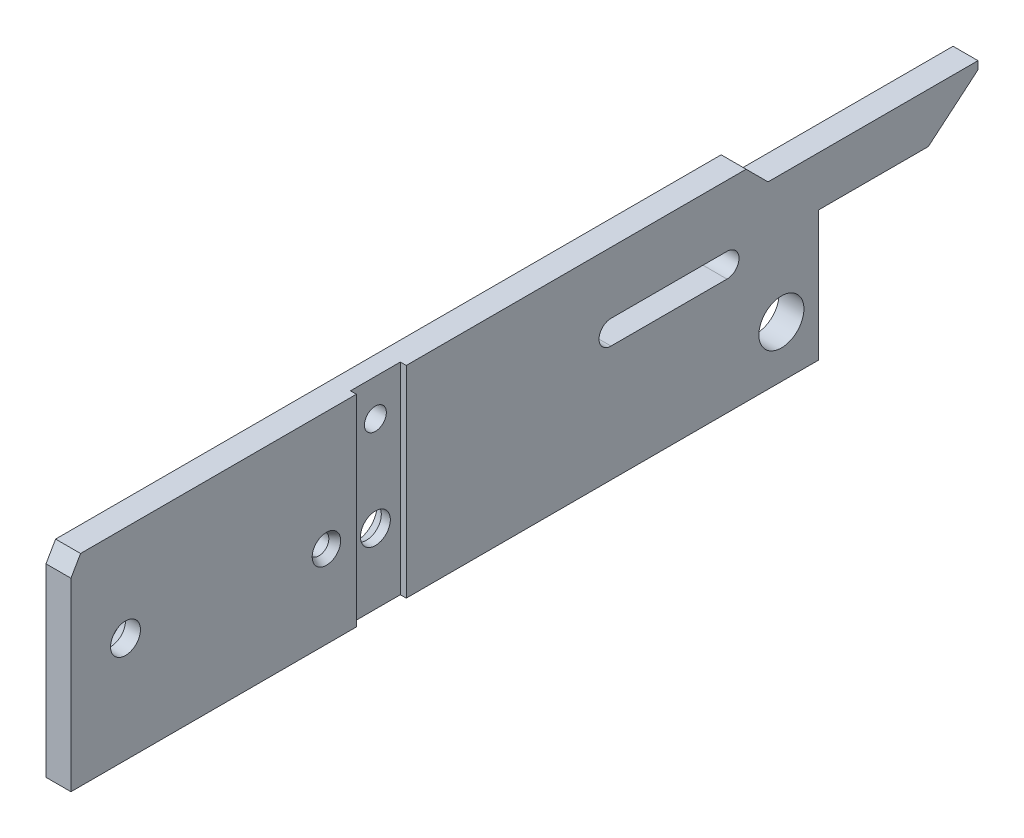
ISO-10303-21;
HEADER;
FILE_DESCRIPTION(('STEP AP214'),'2;1');
FILE_NAME('part.step','',(''),(''),'','','');
FILE_SCHEMA(('AUTOMOTIVE_DESIGN { 1 0 10303 214 1 1 1 1 }'));
ENDSEC;
DATA;
#1=APPLICATION_CONTEXT('core data for automotive mechanical design processes');
#2=APPLICATION_PROTOCOL_DEFINITION('international standard','automotive_design',2000,#1);
#3=PRODUCT_CONTEXT('',#1,'mechanical');
#4=PRODUCT('Part','Part','',(#3));
#5=PRODUCT_RELATED_PRODUCT_CATEGORY('part','',(#4));
#6=PRODUCT_DEFINITION_FORMATION('','',#4);
#7=PRODUCT_DEFINITION_CONTEXT('part definition',#1,'design');
#8=PRODUCT_DEFINITION('design','',#6,#7);
#9=PRODUCT_DEFINITION_SHAPE('','',#8);
#10=(LENGTH_UNIT() NAMED_UNIT(*) SI_UNIT(.MILLI.,.METRE.));
#11=(NAMED_UNIT(*) PLANE_ANGLE_UNIT() SI_UNIT($,.RADIAN.));
#12=(NAMED_UNIT(*) SI_UNIT($,.STERADIAN.) SOLID_ANGLE_UNIT());
#13=UNCERTAINTY_MEASURE_WITH_UNIT(LENGTH_MEASURE(1.E-05),#10,'distance_accuracy_value','');
#14=(GEOMETRIC_REPRESENTATION_CONTEXT(3) GLOBAL_UNCERTAINTY_ASSIGNED_CONTEXT((#13)) GLOBAL_UNIT_ASSIGNED_CONTEXT((#10,
#11,#12)) REPRESENTATION_CONTEXT('',''));
#15=CARTESIAN_POINT('',(0.,0.,0.));
#16=DIRECTION('',(0.,0.,1.));
#17=DIRECTION('',(1.,0.,0.));
#18=AXIS2_PLACEMENT_3D('',#15,#16,#17);
#19=CARTESIAN_POINT('',(3.9624,0.,0.));
#20=DIRECTION('',(-1.,0.,0.));
#21=DIRECTION('',(0.,0.,1.));
#22=AXIS2_PLACEMENT_3D('',#19,#20,#21);
#23=PLANE('',#22);
#24=CARTESIAN_POINT('',(3.9624,4.9276,72.2376));
#25=DIRECTION('',(-1.,0.,0.));
#26=DIRECTION('',(0.,0.,1.));
#27=AXIS2_PLACEMENT_3D('',#24,#25,#26);
#28=CIRCLE('',#27,2.26220766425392);
#29=CARTESIAN_POINT('',(3.9624,4.9276,74.4998076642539));
#30=VERTEX_POINT('',#29);
#31=EDGE_CURVE('E12',#30,#30,#28,.T.);
#32=ORIENTED_EDGE('',*,*,#31,.T.);
#33=EDGE_LOOP('',(#32));
#34=FACE_BOUND('',#33,.T.);
#35=CARTESIAN_POINT('',(3.9624,8.5852,104.14));
#36=DIRECTION('',(1.,0.,0.));
#37=DIRECTION('',(0.,0.,-1.));
#38=AXIS2_PLACEMENT_3D('',#35,#36,#37);
#39=CIRCLE('',#38,2.3749);
#40=CARTESIAN_POINT('',(3.9624,8.5852,101.7651));
#41=VERTEX_POINT('',#40);
#42=EDGE_CURVE('E224',#41,#41,#39,.T.);
#43=ORIENTED_EDGE('',*,*,#42,.F.);
#44=EDGE_LOOP('',(#43));
#45=FACE_BOUND('',#44,.T.);
#46=DIRECTION('',(0.,0.,-1.));
#47=VECTOR('',#46,1.);
#48=CARTESIAN_POINT('',(3.9624,-8.2042,112.8014));
#49=LINE('',#48,#47);
#50=CARTESIAN_POINT('',(3.9624,-8.2042,112.8014));
#51=VERTEX_POINT('',#50);
#52=CARTESIAN_POINT('',(3.9624,-8.2042,67.4878));
#53=VERTEX_POINT('',#52);
#54=EDGE_CURVE('E262',#51,#53,#49,.T.);
#55=ORIENTED_EDGE('',*,*,#54,.T.);
#56=DIRECTION('',(0.,-1.,0.));
#57=VECTOR('',#56,1.);
#58=CARTESIAN_POINT('',(3.9624,23.7998,67.4878));
#59=LINE('',#58,#57);
#60=CARTESIAN_POINT('',(3.9624,23.7998,67.4878));
#61=VERTEX_POINT('',#60);
#62=EDGE_CURVE('E179',#61,#53,#59,.T.);
#63=ORIENTED_EDGE('',*,*,#62,.F.);
#64=DIRECTION('',(0.,0.,1.));
#65=VECTOR('',#64,1.);
#66=CARTESIAN_POINT('',(3.9624,23.7998,5.60069999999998));
#67=LINE('',#66,#65);
#68=CARTESIAN_POINT('',(3.9624,23.7998,111.2774));
#69=VERTEX_POINT('',#68);
#70=EDGE_CURVE('E184',#61,#69,#67,.T.);
#71=ORIENTED_EDGE('',*,*,#70,.T.);
#72=DIRECTION('',(0.,-0.866025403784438,0.500000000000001));
#73=VECTOR('',#72,1.);
#74=CARTESIAN_POINT('',(3.9624,23.7998,111.2774));
#75=LINE('',#74,#73);
#76=CARTESIAN_POINT('',(3.9624,21.160154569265,112.8014));
#77=VERTEX_POINT('',#76);
#78=EDGE_CURVE('E257',#69,#77,#75,.T.);
#79=ORIENTED_EDGE('',*,*,#78,.T.);
#80=DIRECTION('',(0.,-1.,0.));
#81=VECTOR('',#80,1.);
#82=CARTESIAN_POINT('',(3.9624,21.160154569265,112.8014));
#83=LINE('',#82,#81);
#84=EDGE_CURVE('E259',#77,#51,#83,.T.);
#85=ORIENTED_EDGE('',*,*,#84,.T.);
#86=EDGE_LOOP('',(#55,#63,#71,#79,#85));
#87=FACE_BOUND('',#86,.T.);
#88=ADVANCED_FACE('F39',(#34,#45,#87),#23,.F.);
#89=CARTESIAN_POINT('',(3.9624,0.,0.));
#90=DIRECTION('',(1.,0.,0.));
#91=DIRECTION('',(0.,0.,-1.));
#92=AXIS2_PLACEMENT_3D('',#89,#90,#91);
#93=CIRCLE('',#92,3.57505);
#94=CARTESIAN_POINT('',(3.9624,0.,-3.57505));
#95=VERTEX_POINT('',#94);
#96=EDGE_CURVE('E234',#95,#95,#93,.T.);
#97=ORIENTED_EDGE('',*,*,#96,.F.);
#98=EDGE_LOOP('',(#97));
#99=FACE_BOUND('',#98,.T.);
#100=CARTESIAN_POINT('',(3.9624,23.7998,5.60069999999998));
#101=VERTEX_POINT('',#100);
#102=CARTESIAN_POINT('',(3.9624,23.7998,59.563));
#103=VERTEX_POINT('',#102);
#104=EDGE_CURVE('E254',#101,#103,#67,.T.);
#105=ORIENTED_EDGE('',*,*,#104,.T.);
#106=DIRECTION('',(0.,1.,0.));
#107=VECTOR('',#106,1.);
#108=CARTESIAN_POINT('',(3.9624,23.7998,59.563));
#109=LINE('',#108,#107);
#110=CARTESIAN_POINT('',(3.9624,-8.2042,59.563));
#111=VERTEX_POINT('',#110);
#112=EDGE_CURVE('E636',#111,#103,#109,.T.);
#113=ORIENTED_EDGE('',*,*,#112,.F.);
#114=CARTESIAN_POINT('',(3.9624,-8.2042,-5.91820000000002));
#115=VERTEX_POINT('',#114);
#116=EDGE_CURVE('E261',#111,#115,#49,.T.);
#117=ORIENTED_EDGE('',*,*,#116,.T.);
#118=DIRECTION('',(0.,1.,0.));
#119=VECTOR('',#118,1.);
#120=CARTESIAN_POINT('',(3.9624,-8.2042,-5.91820000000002));
#121=LINE('',#120,#119);
#122=CARTESIAN_POINT('',(3.9624,12.446,-5.91820000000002));
#123=VERTEX_POINT('',#122);
#124=EDGE_CURVE('E240',#115,#123,#121,.T.);
#125=ORIENTED_EDGE('',*,*,#124,.T.);
#126=DIRECTION('',(0.,0.,-1.));
#127=VECTOR('',#126,1.);
#128=CARTESIAN_POINT('',(3.9624,12.446,-5.91820000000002));
#129=LINE('',#128,#127);
#130=CARTESIAN_POINT('',(3.9624,12.446,-23.3283730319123));
#131=VERTEX_POINT('',#130);
#132=EDGE_CURVE('E243',#123,#131,#129,.T.);
#133=ORIENTED_EDGE('',*,*,#132,.T.);
#134=DIRECTION('',(0.,0.642787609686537,-0.76604444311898));
#135=VECTOR('',#134,1.);
#136=CARTESIAN_POINT('',(3.9624,12.446,-23.3283730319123));
#137=LINE('',#136,#135);
#138=CARTESIAN_POINT('',(3.9624,19.065008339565,-31.2166));
#139=VERTEX_POINT('',#138);
#140=EDGE_CURVE('E246',#131,#139,#137,.T.);
#141=ORIENTED_EDGE('',*,*,#140,.T.);
#142=DIRECTION('',(0.,1.,0.));
#143=VECTOR('',#142,1.);
#144=CARTESIAN_POINT('',(3.9624,19.065008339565,-31.2166));
#145=LINE('',#144,#143);
#146=CARTESIAN_POINT('',(3.9624,20.32,-31.2166));
#147=VERTEX_POINT('',#146);
#148=EDGE_CURVE('E248',#139,#147,#145,.T.);
#149=ORIENTED_EDGE('',*,*,#148,.T.);
#150=DIRECTION('',(0.,0.,1.));
#151=VECTOR('',#150,1.);
#152=CARTESIAN_POINT('',(3.9624,20.32,-31.2166));
#153=LINE('',#152,#151);
#154=CARTESIAN_POINT('',(3.9624,20.32,2.12089999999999));
#155=VERTEX_POINT('',#154);
#156=EDGE_CURVE('E250',#147,#155,#153,.T.);
#157=ORIENTED_EDGE('',*,*,#156,.T.);
#158=DIRECTION('',(0.,0.707106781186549,0.707106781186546));
#159=VECTOR('',#158,1.);
#160=CARTESIAN_POINT('',(3.9624,20.32,2.12089999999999));
#161=LINE('',#160,#159);
#162=EDGE_CURVE('E252',#155,#101,#161,.T.);
#163=ORIENTED_EDGE('',*,*,#162,.T.);
#164=EDGE_LOOP('',(#105,#113,#117,#125,#133,#141,#149,#157,#163));
#165=FACE_BOUND('',#164,.T.);
#166=CARTESIAN_POINT('',(3.9624,12.1158,27.051));
#167=DIRECTION('',(1.,0.,0.));
#168=DIRECTION('',(0.,0.,-1.));
#169=AXIS2_PLACEMENT_3D('',#166,#167,#168);
#170=CIRCLE('',#169,1.905);
#171=CARTESIAN_POINT('',(3.9624,14.0208,27.051));
#172=VERTEX_POINT('',#171);
#173=CARTESIAN_POINT('',(3.9624,10.2108,27.051));
#174=VERTEX_POINT('',#173);
#175=EDGE_CURVE('E196',#172,#174,#170,.T.);
#176=ORIENTED_EDGE('',*,*,#175,.F.);
#177=DIRECTION('',(0.,0.,1.));
#178=VECTOR('',#177,1.);
#179=CARTESIAN_POINT('',(3.9624,14.0208,27.051));
#180=LINE('',#179,#178);
#181=CARTESIAN_POINT('',(3.9624,14.0208,8.636));
#182=VERTEX_POINT('',#181);
#183=EDGE_CURVE('E203',#182,#172,#180,.T.);
#184=ORIENTED_EDGE('',*,*,#183,.F.);
#185=CARTESIAN_POINT('',(3.9624,12.1158,8.636));
#186=DIRECTION('',(1.,0.,0.));
#187=DIRECTION('',(0.,0.,-1.));
#188=AXIS2_PLACEMENT_3D('',#185,#186,#187);
#189=CIRCLE('',#188,1.905);
#190=CARTESIAN_POINT('',(3.9624,10.2108,8.636));
#191=VERTEX_POINT('',#190);
#192=EDGE_CURVE('E201',#191,#182,#189,.T.);
#193=ORIENTED_EDGE('',*,*,#192,.F.);
#194=DIRECTION('',(0.,0.,-1.));
#195=VECTOR('',#194,1.);
#196=CARTESIAN_POINT('',(3.9624,10.2108,27.051));
#197=LINE('',#196,#195);
#198=EDGE_CURVE('E198',#174,#191,#197,.T.);
#199=ORIENTED_EDGE('',*,*,#198,.F.);
#200=EDGE_LOOP('',(#176,#184,#193,#199));
#201=FACE_BOUND('',#200,.T.);
#202=ADVANCED_FACE('F343',(#99,#165,#201),#23,.F.);
#203=CARTESIAN_POINT('',(0.,0.,0.));
#204=DIRECTION('',(-1.,0.,0.));
#205=DIRECTION('',(0.,0.,1.));
#206=AXIS2_PLACEMENT_3D('',#203,#204,#205);
#207=PLANE('',#206);
#208=CARTESIAN_POINT('',(0.,2.921,63.5254));
#209=DIRECTION('',(-1.,0.,0.));
#210=DIRECTION('',(0.,0.,1.));
#211=AXIS2_PLACEMENT_3D('',#208,#209,#210);
#212=CIRCLE('',#211,3.29144355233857);
#213=CARTESIAN_POINT('',(0.,2.921,66.8168435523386));
#214=VERTEX_POINT('',#213);
#215=EDGE_CURVE('E319',#214,#214,#212,.F.);
#216=ORIENTED_EDGE('',*,*,#215,.T.);
#217=EDGE_LOOP('',(#216));
#218=FACE_BOUND('',#217,.T.);
#219=CARTESIAN_POINT('',(0.,8.5852,104.14));
#220=DIRECTION('',(-1.,0.,0.));
#221=DIRECTION('',(0.,0.,1.));
#222=AXIS2_PLACEMENT_3D('',#219,#220,#221);
#223=CIRCLE('',#222,3.29144355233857);
#224=CARTESIAN_POINT('',(0.,8.5852,107.431443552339));
#225=VERTEX_POINT('',#224);
#226=EDGE_CURVE('E314',#225,#225,#223,.F.);
#227=ORIENTED_EDGE('',*,*,#226,.T.);
#228=EDGE_LOOP('',(#227));
#229=FACE_BOUND('',#228,.T.);
#230=CARTESIAN_POINT('',(0.,17.9832,63.5254));
#231=DIRECTION('',(1.,0.,0.));
#232=DIRECTION('',(0.,0.,-1.));
#233=AXIS2_PLACEMENT_3D('',#230,#231,#232);
#234=CIRCLE('',#233,1.7399);
#235=CARTESIAN_POINT('',(0.,17.9832,61.7855));
#236=VERTEX_POINT('',#235);
#237=EDGE_CURVE('E230',#236,#236,#234,.T.);
#238=ORIENTED_EDGE('',*,*,#237,.T.);
#239=EDGE_LOOP('',(#238));
#240=FACE_BOUND('',#239,.T.);
#241=CARTESIAN_POINT('',(0.,0.,0.));
#242=DIRECTION('',(1.,0.,0.));
#243=DIRECTION('',(0.,0.,-1.));
#244=AXIS2_PLACEMENT_3D('',#241,#242,#243);
#245=CIRCLE('',#244,3.57505);
#246=CARTESIAN_POINT('',(0.,0.,-3.57505));
#247=VERTEX_POINT('',#246);
#248=EDGE_CURVE('E233',#247,#247,#245,.T.);
#249=ORIENTED_EDGE('',*,*,#248,.T.);
#250=EDGE_LOOP('',(#249));
#251=FACE_BOUND('',#250,.T.);
#252=DIRECTION('',(0.,1.,0.));
#253=VECTOR('',#252,1.);
#254=CARTESIAN_POINT('',(0.,-8.2042,-5.91820000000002));
#255=LINE('',#254,#253);
#256=CARTESIAN_POINT('',(0.,-8.2042,-5.91820000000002));
#257=VERTEX_POINT('',#256);
#258=CARTESIAN_POINT('',(0.,12.446,-5.91820000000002));
#259=VERTEX_POINT('',#258);
#260=EDGE_CURVE('E237',#257,#259,#255,.T.);
#261=ORIENTED_EDGE('',*,*,#260,.F.);
#262=DIRECTION('',(0.,0.,-1.));
#263=VECTOR('',#262,1.);
#264=CARTESIAN_POINT('',(0.,-8.2042,112.8014));
#265=LINE('',#264,#263);
#266=CARTESIAN_POINT('',(0.,-8.2042,112.8014));
#267=VERTEX_POINT('',#266);
#268=EDGE_CURVE('E244',#267,#257,#265,.T.);
#269=ORIENTED_EDGE('',*,*,#268,.F.);
#270=DIRECTION('',(0.,-1.,0.));
#271=VECTOR('',#270,1.);
#272=CARTESIAN_POINT('',(0.,21.160154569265,112.8014));
#273=LINE('',#272,#271);
#274=CARTESIAN_POINT('',(0.,21.160154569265,112.8014));
#275=VERTEX_POINT('',#274);
#276=EDGE_CURVE('E282',#275,#267,#273,.T.);
#277=ORIENTED_EDGE('',*,*,#276,.F.);
#278=DIRECTION('',(0.,-0.866025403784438,0.500000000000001));
#279=VECTOR('',#278,1.);
#280=CARTESIAN_POINT('',(0.,23.7998,111.2774));
#281=LINE('',#280,#279);
#282=CARTESIAN_POINT('',(0.,23.7998,111.2774));
#283=VERTEX_POINT('',#282);
#284=EDGE_CURVE('E280',#283,#275,#281,.T.);
#285=ORIENTED_EDGE('',*,*,#284,.F.);
#286=DIRECTION('',(0.,0.,1.));
#287=VECTOR('',#286,1.);
#288=CARTESIAN_POINT('',(0.,23.7998,5.60069999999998));
#289=LINE('',#288,#287);
#290=CARTESIAN_POINT('',(0.,23.7998,5.60069999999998));
#291=VERTEX_POINT('',#290);
#292=EDGE_CURVE('E278',#291,#283,#289,.T.);
#293=ORIENTED_EDGE('',*,*,#292,.F.);
#294=DIRECTION('',(0.,0.707106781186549,0.707106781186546));
#295=VECTOR('',#294,1.);
#296=CARTESIAN_POINT('',(0.,20.32,2.12089999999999));
#297=LINE('',#296,#295);
#298=CARTESIAN_POINT('',(0.,20.32,2.12089999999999));
#299=VERTEX_POINT('',#298);
#300=EDGE_CURVE('E276',#299,#291,#297,.T.);
#301=ORIENTED_EDGE('',*,*,#300,.F.);
#302=DIRECTION('',(0.,0.,1.));
#303=VECTOR('',#302,1.);
#304=CARTESIAN_POINT('',(0.,20.32,-31.2166));
#305=LINE('',#304,#303);
#306=CARTESIAN_POINT('',(0.,20.32,-31.2166));
#307=VERTEX_POINT('',#306);
#308=EDGE_CURVE('E274',#307,#299,#305,.T.);
#309=ORIENTED_EDGE('',*,*,#308,.F.);
#310=DIRECTION('',(0.,1.,0.));
#311=VECTOR('',#310,1.);
#312=CARTESIAN_POINT('',(0.,19.065008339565,-31.2166));
#313=LINE('',#312,#311);
#314=CARTESIAN_POINT('',(0.,19.065008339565,-31.2166));
#315=VERTEX_POINT('',#314);
#316=EDGE_CURVE('E272',#315,#307,#313,.T.);
#317=ORIENTED_EDGE('',*,*,#316,.F.);
#318=DIRECTION('',(0.,0.642787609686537,-0.76604444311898));
#319=VECTOR('',#318,1.);
#320=CARTESIAN_POINT('',(0.,12.446,-23.3283730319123));
#321=LINE('',#320,#319);
#322=CARTESIAN_POINT('',(0.,12.446,-23.3283730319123));
#323=VERTEX_POINT('',#322);
#324=EDGE_CURVE('E270',#323,#315,#321,.T.);
#325=ORIENTED_EDGE('',*,*,#324,.F.);
#326=DIRECTION('',(0.,0.,-1.));
#327=VECTOR('',#326,1.);
#328=CARTESIAN_POINT('',(0.,12.446,-5.91820000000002));
#329=LINE('',#328,#327);
#330=EDGE_CURVE('E268',#259,#323,#329,.T.);
#331=ORIENTED_EDGE('',*,*,#330,.F.);
#332=EDGE_LOOP('',(#261,#269,#277,#285,#293,#301,#309,#317,#325,#331));
#333=FACE_BOUND('',#332,.T.);
#334=CARTESIAN_POINT('',(0.,4.9276,72.2376));
#335=DIRECTION('',(1.,0.,0.));
#336=DIRECTION('',(0.,0.,-1.));
#337=AXIS2_PLACEMENT_3D('',#334,#335,#336);
#338=CIRCLE('',#337,1.5748);
#339=CARTESIAN_POINT('',(0.,4.9276,70.6628));
#340=VERTEX_POINT('',#339);
#341=EDGE_CURVE('E227',#340,#340,#338,.T.);
#342=ORIENTED_EDGE('',*,*,#341,.T.);
#343=EDGE_LOOP('',(#342));
#344=FACE_BOUND('',#343,.T.);
#345=DIRECTION('',(0.,0.,1.));
#346=VECTOR('',#345,1.);
#347=CARTESIAN_POINT('',(0.,14.0208,27.051));
#348=LINE('',#347,#346);
#349=CARTESIAN_POINT('',(0.,14.0208,8.636));
#350=VERTEX_POINT('',#349);
#351=CARTESIAN_POINT('',(0.,14.0208,27.051));
#352=VERTEX_POINT('',#351);
#353=EDGE_CURVE('E199',#350,#352,#348,.T.);
#354=ORIENTED_EDGE('',*,*,#353,.T.);
#355=CARTESIAN_POINT('',(0.,12.1158,27.051));
#356=DIRECTION('',(1.,0.,0.));
#357=DIRECTION('',(0.,0.,-1.));
#358=AXIS2_PLACEMENT_3D('',#355,#356,#357);
#359=CIRCLE('',#358,1.905);
#360=CARTESIAN_POINT('',(0.,10.2108,27.051));
#361=VERTEX_POINT('',#360);
#362=EDGE_CURVE('E195',#352,#361,#359,.T.);
#363=ORIENTED_EDGE('',*,*,#362,.T.);
#364=DIRECTION('',(0.,0.,-1.));
#365=VECTOR('',#364,1.);
#366=CARTESIAN_POINT('',(0.,10.2108,27.051));
#367=LINE('',#366,#365);
#368=CARTESIAN_POINT('',(0.,10.2108,8.636));
#369=VERTEX_POINT('',#368);
#370=EDGE_CURVE('E208',#361,#369,#367,.T.);
#371=ORIENTED_EDGE('',*,*,#370,.T.);
#372=CARTESIAN_POINT('',(0.,12.1158,8.636));
#373=DIRECTION('',(1.,0.,0.));
#374=DIRECTION('',(0.,0.,-1.));
#375=AXIS2_PLACEMENT_3D('',#372,#373,#374);
#376=CIRCLE('',#375,1.905);
#377=EDGE_CURVE('E211',#369,#350,#376,.T.);
#378=ORIENTED_EDGE('',*,*,#377,.T.);
#379=EDGE_LOOP('',(#354,#363,#371,#378));
#380=FACE_BOUND('',#379,.T.);
#381=ADVANCED_FACE('F349',(#218,#229,#240,#251,#333,#344,#380),#207,.T.);
#382=CARTESIAN_POINT('',(3.9624,-8.2042,-5.91820000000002));
#383=DIRECTION('',(0.,0.,1.));
#384=DIRECTION('',(1.,0.,0.));
#385=AXIS2_PLACEMENT_3D('',#382,#383,#384);
#386=PLANE('',#385);
#387=ORIENTED_EDGE('',*,*,#260,.T.);
#388=DIRECTION('',(-1.,0.,0.));
#389=VECTOR('',#388,1.);
#390=CARTESIAN_POINT('',(3.9624,12.446,-5.91820000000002));
#391=LINE('',#390,#389);
#392=EDGE_CURVE('E311',#123,#259,#391,.T.);
#393=ORIENTED_EDGE('',*,*,#392,.F.);
#394=ORIENTED_EDGE('',*,*,#124,.F.);
#395=DIRECTION('',(-1.,0.,0.));
#396=VECTOR('',#395,1.);
#397=CARTESIAN_POINT('',(3.9624,-8.2042,-5.91820000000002));
#398=LINE('',#397,#396);
#399=EDGE_CURVE('E265',#115,#257,#398,.T.);
#400=ORIENTED_EDGE('',*,*,#399,.T.);
#401=EDGE_LOOP('',(#387,#393,#394,#400));
#402=FACE_BOUND('',#401,.T.);
#403=ADVANCED_FACE('F358',(#402),#386,.F.);
#404=CARTESIAN_POINT('',(3.9624,12.446,-5.91820000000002));
#405=DIRECTION('',(0.,1.,0.));
#406=DIRECTION('',(0.,0.,1.));
#407=AXIS2_PLACEMENT_3D('',#404,#405,#406);
#408=PLANE('',#407);
#409=ORIENTED_EDGE('',*,*,#330,.T.);
#410=DIRECTION('',(-1.,0.,0.));
#411=VECTOR('',#410,1.);
#412=CARTESIAN_POINT('',(3.9624,12.446,-23.3283730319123));
#413=LINE('',#412,#411);
#414=EDGE_CURVE('E308',#131,#323,#413,.T.);
#415=ORIENTED_EDGE('',*,*,#414,.F.);
#416=ORIENTED_EDGE('',*,*,#132,.F.);
#417=ORIENTED_EDGE('',*,*,#392,.T.);
#418=EDGE_LOOP('',(#409,#415,#416,#417));
#419=FACE_BOUND('',#418,.T.);
#420=ADVANCED_FACE('F389',(#419),#408,.F.);
#421=CARTESIAN_POINT('',(3.9624,12.446,-23.3283730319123));
#422=DIRECTION('',(0.,0.766044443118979,0.642787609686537));
#423=DIRECTION('',(0.,-0.642787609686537,0.76604444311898));
#424=AXIS2_PLACEMENT_3D('',#421,#422,#423);
#425=PLANE('',#424);
#426=ORIENTED_EDGE('',*,*,#324,.T.);
#427=DIRECTION('',(-1.,0.,0.));
#428=VECTOR('',#427,1.);
#429=CARTESIAN_POINT('',(3.9624,19.065008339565,-31.2166));
#430=LINE('',#429,#428);
#431=EDGE_CURVE('E305',#139,#315,#430,.T.);
#432=ORIENTED_EDGE('',*,*,#431,.F.);
#433=ORIENTED_EDGE('',*,*,#140,.F.);
#434=ORIENTED_EDGE('',*,*,#414,.T.);
#435=EDGE_LOOP('',(#426,#432,#433,#434));
#436=FACE_BOUND('',#435,.T.);
#437=ADVANCED_FACE('F385',(#436),#425,.F.);
#438=CARTESIAN_POINT('',(3.9624,19.065008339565,-31.2166));
#439=DIRECTION('',(0.,0.,1.));
#440=DIRECTION('',(1.,0.,0.));
#441=AXIS2_PLACEMENT_3D('',#438,#439,#440);
#442=PLANE('',#441);
#443=ORIENTED_EDGE('',*,*,#316,.T.);
#444=DIRECTION('',(-1.,0.,0.));
#445=VECTOR('',#444,1.);
#446=CARTESIAN_POINT('',(3.9624,20.32,-31.2166));
#447=LINE('',#446,#445);
#448=EDGE_CURVE('E302',#147,#307,#447,.T.);
#449=ORIENTED_EDGE('',*,*,#448,.F.);
#450=ORIENTED_EDGE('',*,*,#148,.F.);
#451=ORIENTED_EDGE('',*,*,#431,.T.);
#452=EDGE_LOOP('',(#443,#449,#450,#451));
#453=FACE_BOUND('',#452,.T.);
#454=ADVANCED_FACE('F381',(#453),#442,.F.);
#455=CARTESIAN_POINT('',(3.9624,20.32,-31.2166));
#456=DIRECTION('',(0.,-1.,0.));
#457=DIRECTION('',(0.,0.,-1.));
#458=AXIS2_PLACEMENT_3D('',#455,#456,#457);
#459=PLANE('',#458);
#460=ORIENTED_EDGE('',*,*,#308,.T.);
#461=DIRECTION('',(-1.,0.,0.));
#462=VECTOR('',#461,1.);
#463=CARTESIAN_POINT('',(3.9624,20.32,2.12089999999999));
#464=LINE('',#463,#462);
#465=EDGE_CURVE('E299',#155,#299,#464,.T.);
#466=ORIENTED_EDGE('',*,*,#465,.F.);
#467=ORIENTED_EDGE('',*,*,#156,.F.);
#468=ORIENTED_EDGE('',*,*,#448,.T.);
#469=EDGE_LOOP('',(#460,#466,#467,#468));
#470=FACE_BOUND('',#469,.T.);
#471=ADVANCED_FACE('F377',(#470),#459,.F.);
#472=CARTESIAN_POINT('',(3.9624,20.32,2.12089999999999));
#473=DIRECTION('',(0.,-0.707106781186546,0.707106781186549));
#474=DIRECTION('',(0.,-0.707106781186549,-0.707106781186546));
#475=AXIS2_PLACEMENT_3D('',#472,#473,#474);
#476=PLANE('',#475);
#477=ORIENTED_EDGE('',*,*,#300,.T.);
#478=DIRECTION('',(-1.,0.,0.));
#479=VECTOR('',#478,1.);
#480=CARTESIAN_POINT('',(3.9624,23.7998,5.60069999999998));
#481=LINE('',#480,#479);
#482=EDGE_CURVE('E296',#101,#291,#481,.T.);
#483=ORIENTED_EDGE('',*,*,#482,.F.);
#484=ORIENTED_EDGE('',*,*,#162,.F.);
#485=ORIENTED_EDGE('',*,*,#465,.T.);
#486=EDGE_LOOP('',(#477,#483,#484,#485));
#487=FACE_BOUND('',#486,.T.);
#488=ADVANCED_FACE('F374',(#487),#476,.F.);
#489=CARTESIAN_POINT('',(3.9624,23.7998,5.60069999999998));
#490=DIRECTION('',(0.,-1.,0.));
#491=DIRECTION('',(0.,0.,-1.));
#492=AXIS2_PLACEMENT_3D('',#489,#490,#491);
#493=PLANE('',#492);
#494=ORIENTED_EDGE('',*,*,#70,.F.);
#495=DIRECTION('',(1.,0.,0.));
#496=VECTOR('',#495,1.);
#497=CARTESIAN_POINT('',(-32.9705697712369,23.7998,67.4878));
#498=LINE('',#497,#496);
#499=CARTESIAN_POINT('',(3.02259999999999,23.7998,67.4878));
#500=VERTEX_POINT('',#499);
#501=EDGE_CURVE('E167',#500,#61,#498,.T.);
#502=ORIENTED_EDGE('',*,*,#501,.F.);
#503=DIRECTION('',(0.,0.,1.));
#504=VECTOR('',#503,1.);
#505=CARTESIAN_POINT('',(3.0226,23.7998,59.563));
#506=LINE('',#505,#504);
#507=CARTESIAN_POINT('',(3.0226,23.7998,59.563));
#508=VERTEX_POINT('',#507);
#509=EDGE_CURVE('E173',#508,#500,#506,.T.);
#510=ORIENTED_EDGE('',*,*,#509,.F.);
#511=DIRECTION('',(1.,0.,0.));
#512=VECTOR('',#511,1.);
#513=CARTESIAN_POINT('',(-32.9705697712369,23.7998,59.563));
#514=LINE('',#513,#512);
#515=EDGE_CURVE('E189',#508,#103,#514,.T.);
#516=ORIENTED_EDGE('',*,*,#515,.T.);
#517=ORIENTED_EDGE('',*,*,#104,.F.);
#518=ORIENTED_EDGE('',*,*,#482,.T.);
#519=ORIENTED_EDGE('',*,*,#292,.T.);
#520=DIRECTION('',(-1.,0.,0.));
#521=VECTOR('',#520,1.);
#522=CARTESIAN_POINT('',(3.9624,23.7998,111.2774));
#523=LINE('',#522,#521);
#524=EDGE_CURVE('E293',#69,#283,#523,.T.);
#525=ORIENTED_EDGE('',*,*,#524,.F.);
#526=EDGE_LOOP('',(#494,#502,#510,#516,#517,#518,#519,#525));
#527=FACE_BOUND('',#526,.T.);
#528=ADVANCED_FACE('F182',(#527),#493,.F.);
#529=CARTESIAN_POINT('',(3.9624,23.7998,111.2774));
#530=DIRECTION('',(0.,-0.500000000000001,-0.866025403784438));
#531=DIRECTION('',(0.,0.866025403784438,-0.500000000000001));
#532=AXIS2_PLACEMENT_3D('',#529,#530,#531);
#533=PLANE('',#532);
#534=ORIENTED_EDGE('',*,*,#284,.T.);
#535=DIRECTION('',(-1.,0.,0.));
#536=VECTOR('',#535,1.);
#537=CARTESIAN_POINT('',(3.9624,21.160154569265,112.8014));
#538=LINE('',#537,#536);
#539=EDGE_CURVE('E290',#77,#275,#538,.T.);
#540=ORIENTED_EDGE('',*,*,#539,.F.);
#541=ORIENTED_EDGE('',*,*,#78,.F.);
#542=ORIENTED_EDGE('',*,*,#524,.T.);
#543=EDGE_LOOP('',(#534,#540,#541,#542));
#544=FACE_BOUND('',#543,.T.);
#545=ADVANCED_FACE('F367',(#544),#533,.F.);
#546=CARTESIAN_POINT('',(3.9624,21.160154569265,112.8014));
#547=DIRECTION('',(0.,0.,-1.));
#548=DIRECTION('',(-1.,0.,0.));
#549=AXIS2_PLACEMENT_3D('',#546,#547,#548);
#550=PLANE('',#549);
#551=ORIENTED_EDGE('',*,*,#276,.T.);
#552=DIRECTION('',(-1.,0.,0.));
#553=VECTOR('',#552,1.);
#554=CARTESIAN_POINT('',(3.9624,-8.2042,112.8014));
#555=LINE('',#554,#553);
#556=EDGE_CURVE('E287',#51,#267,#555,.T.);
#557=ORIENTED_EDGE('',*,*,#556,.F.);
#558=ORIENTED_EDGE('',*,*,#84,.F.);
#559=ORIENTED_EDGE('',*,*,#539,.T.);
#560=EDGE_LOOP('',(#551,#557,#558,#559));
#561=FACE_BOUND('',#560,.T.);
#562=ADVANCED_FACE('F363',(#561),#550,.F.);
#563=CARTESIAN_POINT('',(3.9624,-8.2042,112.8014));
#564=DIRECTION('',(0.,1.,0.));
#565=DIRECTION('',(0.,0.,1.));
#566=AXIS2_PLACEMENT_3D('',#563,#564,#565);
#567=PLANE('',#566);
#568=DIRECTION('',(0.,0.,-1.));
#569=VECTOR('',#568,1.);
#570=CARTESIAN_POINT('',(3.0226,-8.2042,59.563));
#571=LINE('',#570,#569);
#572=CARTESIAN_POINT('',(3.0226,-8.20419999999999,67.4878));
#573=VERTEX_POINT('',#572);
#574=CARTESIAN_POINT('',(3.02259999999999,-8.2042,59.563));
#575=VERTEX_POINT('',#574);
#576=EDGE_CURVE('E54',#573,#575,#571,.T.);
#577=ORIENTED_EDGE('',*,*,#576,.F.);
#578=DIRECTION('',(1.,0.,0.));
#579=VECTOR('',#578,1.);
#580=CARTESIAN_POINT('',(-32.9705697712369,-8.2042,67.4878));
#581=LINE('',#580,#579);
#582=EDGE_CURVE('E170',#573,#53,#581,.T.);
#583=ORIENTED_EDGE('',*,*,#582,.T.);
#584=ORIENTED_EDGE('',*,*,#54,.F.);
#585=ORIENTED_EDGE('',*,*,#556,.T.);
#586=ORIENTED_EDGE('',*,*,#268,.T.);
#587=ORIENTED_EDGE('',*,*,#399,.F.);
#588=ORIENTED_EDGE('',*,*,#116,.F.);
#589=DIRECTION('',(1.,0.,0.));
#590=VECTOR('',#589,1.);
#591=CARTESIAN_POINT('',(-32.9705697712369,-8.2042,59.563));
#592=LINE('',#591,#590);
#593=EDGE_CURVE('E642',#575,#111,#592,.T.);
#594=ORIENTED_EDGE('',*,*,#593,.F.);
#595=EDGE_LOOP('',(#577,#583,#584,#585,#586,#587,#588,#594));
#596=FACE_BOUND('',#595,.T.);
#597=ADVANCED_FACE('F360',(#596),#567,.F.);
#598=CARTESIAN_POINT('',(3.9624,0.,0.));
#599=DIRECTION('',(-1.,0.,0.));
#600=DIRECTION('',(0.,0.,1.));
#601=AXIS2_PLACEMENT_3D('',#598,#599,#600);
#602=CYLINDRICAL_SURFACE('',#601,3.57505);
#603=ORIENTED_EDGE('',*,*,#96,.T.);
#604=EDGE_LOOP('',(#603));
#605=FACE_BOUND('',#604,.T.);
#606=ORIENTED_EDGE('',*,*,#248,.F.);
#607=EDGE_LOOP('',(#606));
#608=FACE_BOUND('',#607,.T.);
#609=ADVANCED_FACE('F354',(#605,#608),#602,.F.);
#610=CARTESIAN_POINT('',(3.9624,2.921,63.5254));
#611=DIRECTION('',(-1.,0.,0.));
#612=DIRECTION('',(0.,0.,1.));
#613=AXIS2_PLACEMENT_3D('',#610,#611,#612);
#614=CYLINDRICAL_SURFACE('',#613,2.3749);
#615=CARTESIAN_POINT('',(1.58750000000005,2.921,63.5254));
#616=DIRECTION('',(-1.,0.,0.));
#617=DIRECTION('',(0.,0.,1.));
#618=AXIS2_PLACEMENT_3D('',#615,#616,#617);
#619=CIRCLE('',#618,2.3749);
#620=CARTESIAN_POINT('',(1.58750000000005,2.921,65.9003));
#621=VERTEX_POINT('',#620);
#622=EDGE_CURVE('E322',#621,#621,#619,.T.);
#623=ORIENTED_EDGE('',*,*,#622,.T.);
#624=EDGE_LOOP('',(#623));
#625=FACE_BOUND('',#624,.T.);
#626=CARTESIAN_POINT('',(3.0226,2.921,63.5254));
#627=DIRECTION('',(-1.,0.,0.));
#628=DIRECTION('',(0.,0.,1.));
#629=AXIS2_PLACEMENT_3D('',#626,#627,#628);
#630=CIRCLE('',#629,2.3749);
#631=CARTESIAN_POINT('',(3.0226,2.921,65.9003));
#632=VERTEX_POINT('',#631);
#633=EDGE_CURVE('E192',#632,#632,#630,.T.);
#634=ORIENTED_EDGE('',*,*,#633,.F.);
#635=EDGE_LOOP('',(#634));
#636=FACE_BOUND('',#635,.T.);
#637=ADVANCED_FACE('F456',(#625,#636),#614,.F.);
#638=CARTESIAN_POINT('',(3.9624,17.9832,63.5254));
#639=DIRECTION('',(-1.,0.,0.));
#640=DIRECTION('',(0.,0.,1.));
#641=AXIS2_PLACEMENT_3D('',#638,#639,#640);
#642=CYLINDRICAL_SURFACE('',#641,1.7399);
#643=CARTESIAN_POINT('',(3.0226,17.9832,63.5254));
#644=DIRECTION('',(-1.,0.,0.));
#645=DIRECTION('',(0.,0.,1.));
#646=AXIS2_PLACEMENT_3D('',#643,#644,#645);
#647=CIRCLE('',#646,1.7399);
#648=CARTESIAN_POINT('',(3.0226,17.9832,65.2653));
#649=VERTEX_POINT('',#648);
#650=EDGE_CURVE('E191',#649,#649,#647,.T.);
#651=ORIENTED_EDGE('',*,*,#650,.F.);
#652=EDGE_LOOP('',(#651));
#653=FACE_BOUND('',#652,.T.);
#654=ORIENTED_EDGE('',*,*,#237,.F.);
#655=EDGE_LOOP('',(#654));
#656=FACE_BOUND('',#655,.T.);
#657=ADVANCED_FACE('F454',(#653,#656),#642,.F.);
#658=CARTESIAN_POINT('',(3.9624,4.9276,72.2376));
#659=DIRECTION('',(-1.,0.,0.));
#660=DIRECTION('',(0.,0.,1.));
#661=AXIS2_PLACEMENT_3D('',#658,#659,#660);
#662=CYLINDRICAL_SURFACE('',#661,1.5748);
#663=CARTESIAN_POINT('',(2.771775,4.9276,72.2376));
#664=DIRECTION('',(-1.,0.,0.));
#665=DIRECTION('',(0.,0.,1.));
#666=AXIS2_PLACEMENT_3D('',#663,#664,#665);
#667=CIRCLE('',#666,1.5748);
#668=CARTESIAN_POINT('',(2.771775,4.9276,73.8124));
#669=VERTEX_POINT('',#668);
#670=EDGE_CURVE('E47',#669,#669,#667,.F.);
#671=ORIENTED_EDGE('',*,*,#670,.T.);
#672=EDGE_LOOP('',(#671));
#673=FACE_BOUND('',#672,.T.);
#674=ORIENTED_EDGE('',*,*,#341,.F.);
#675=EDGE_LOOP('',(#674));
#676=FACE_BOUND('',#675,.T.);
#677=ADVANCED_FACE('F330',(#673,#676),#662,.F.);
#678=CARTESIAN_POINT('',(3.9624,8.5852,104.14));
#679=DIRECTION('',(-1.,0.,0.));
#680=DIRECTION('',(0.,0.,1.));
#681=AXIS2_PLACEMENT_3D('',#678,#679,#680);
#682=CYLINDRICAL_SURFACE('',#681,2.3749);
#683=CARTESIAN_POINT('',(1.58750000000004,8.5852,104.14));
#684=DIRECTION('',(-1.,0.,0.));
#685=DIRECTION('',(0.,0.,1.));
#686=AXIS2_PLACEMENT_3D('',#683,#684,#685);
#687=CIRCLE('',#686,2.3749);
#688=CARTESIAN_POINT('',(1.58750000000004,8.5852,106.5149));
#689=VERTEX_POINT('',#688);
#690=EDGE_CURVE('E325',#689,#689,#687,.T.);
#691=ORIENTED_EDGE('',*,*,#690,.T.);
#692=EDGE_LOOP('',(#691));
#693=FACE_BOUND('',#692,.T.);
#694=ORIENTED_EDGE('',*,*,#42,.T.);
#695=EDGE_LOOP('',(#694));
#696=FACE_BOUND('',#695,.T.);
#697=ADVANCED_FACE('F448',(#693,#696),#682,.F.);
#698=CARTESIAN_POINT('',(3.9624,12.1158,27.051));
#699=DIRECTION('',(-1.,0.,0.));
#700=DIRECTION('',(0.,0.,1.));
#701=AXIS2_PLACEMENT_3D('',#698,#699,#700);
#702=CYLINDRICAL_SURFACE('',#701,1.905);
#703=ORIENTED_EDGE('',*,*,#362,.F.);
#704=DIRECTION('',(-1.,0.,0.));
#705=VECTOR('',#704,1.);
#706=CARTESIAN_POINT('',(3.9624,14.0208,27.051));
#707=LINE('',#706,#705);
#708=EDGE_CURVE('E205',#172,#352,#707,.T.);
#709=ORIENTED_EDGE('',*,*,#708,.F.);
#710=ORIENTED_EDGE('',*,*,#175,.T.);
#711=DIRECTION('',(-1.,0.,0.));
#712=VECTOR('',#711,1.);
#713=CARTESIAN_POINT('',(3.9624,10.2108,27.051));
#714=LINE('',#713,#712);
#715=EDGE_CURVE('E221',#174,#361,#714,.T.);
#716=ORIENTED_EDGE('',*,*,#715,.T.);
#717=EDGE_LOOP('',(#703,#709,#710,#716));
#718=FACE_BOUND('',#717,.T.);
#719=ADVANCED_FACE('F426',(#718),#702,.F.);
#720=CARTESIAN_POINT('',(3.9624,10.2108,27.051));
#721=DIRECTION('',(0.,1.,0.));
#722=DIRECTION('',(0.,0.,1.));
#723=AXIS2_PLACEMENT_3D('',#720,#721,#722);
#724=PLANE('',#723);
#725=ORIENTED_EDGE('',*,*,#370,.F.);
#726=ORIENTED_EDGE('',*,*,#715,.F.);
#727=ORIENTED_EDGE('',*,*,#198,.T.);
#728=DIRECTION('',(-1.,0.,0.));
#729=VECTOR('',#728,1.);
#730=CARTESIAN_POINT('',(3.9624,10.2108,8.636));
#731=LINE('',#730,#729);
#732=EDGE_CURVE('E219',#191,#369,#731,.T.);
#733=ORIENTED_EDGE('',*,*,#732,.T.);
#734=EDGE_LOOP('',(#725,#726,#727,#733));
#735=FACE_BOUND('',#734,.T.);
#736=ADVANCED_FACE('F433',(#735),#724,.T.);
#737=CARTESIAN_POINT('',(3.9624,12.1158,8.636));
#738=DIRECTION('',(-1.,0.,0.));
#739=DIRECTION('',(0.,0.,1.));
#740=AXIS2_PLACEMENT_3D('',#737,#738,#739);
#741=CYLINDRICAL_SURFACE('',#740,1.905);
#742=ORIENTED_EDGE('',*,*,#377,.F.);
#743=ORIENTED_EDGE('',*,*,#732,.F.);
#744=ORIENTED_EDGE('',*,*,#192,.T.);
#745=DIRECTION('',(-1.,0.,0.));
#746=VECTOR('',#745,1.);
#747=CARTESIAN_POINT('',(3.9624,14.0208,8.636));
#748=LINE('',#747,#746);
#749=EDGE_CURVE('E62',#182,#350,#748,.T.);
#750=ORIENTED_EDGE('',*,*,#749,.T.);
#751=EDGE_LOOP('',(#742,#743,#744,#750));
#752=FACE_BOUND('',#751,.T.);
#753=ADVANCED_FACE('F435',(#752),#741,.F.);
#754=CARTESIAN_POINT('',(3.9624,14.0208,27.051));
#755=DIRECTION('',(0.,-1.,0.));
#756=DIRECTION('',(0.,0.,-1.));
#757=AXIS2_PLACEMENT_3D('',#754,#755,#756);
#758=PLANE('',#757);
#759=ORIENTED_EDGE('',*,*,#353,.F.);
#760=ORIENTED_EDGE('',*,*,#749,.F.);
#761=ORIENTED_EDGE('',*,*,#183,.T.);
#762=ORIENTED_EDGE('',*,*,#708,.T.);
#763=EDGE_LOOP('',(#759,#760,#761,#762));
#764=FACE_BOUND('',#763,.T.);
#765=ADVANCED_FACE('F421',(#764),#758,.T.);
#766=CARTESIAN_POINT('',(3.0226,0.,0.));
#767=DIRECTION('',(-1.,0.,0.));
#768=DIRECTION('',(0.,0.,1.));
#769=AXIS2_PLACEMENT_3D('',#766,#767,#768);
#770=PLANE('',#769);
#771=ORIENTED_EDGE('',*,*,#633,.T.);
#772=EDGE_LOOP('',(#771));
#773=FACE_BOUND('',#772,.T.);
#774=ORIENTED_EDGE('',*,*,#650,.T.);
#775=EDGE_LOOP('',(#774));
#776=FACE_BOUND('',#775,.T.);
#777=DIRECTION('',(0.,1.,0.));
#778=VECTOR('',#777,1.);
#779=CARTESIAN_POINT('',(3.0226,23.7998,59.563));
#780=LINE('',#779,#778);
#781=EDGE_CURVE('E175',#575,#508,#780,.T.);
#782=ORIENTED_EDGE('',*,*,#781,.T.);
#783=ORIENTED_EDGE('',*,*,#509,.T.);
#784=DIRECTION('',(0.,-1.,0.));
#785=VECTOR('',#784,1.);
#786=CARTESIAN_POINT('',(3.0226,23.7998,67.4878));
#787=LINE('',#786,#785);
#788=EDGE_CURVE('E163',#500,#573,#787,.T.);
#789=ORIENTED_EDGE('',*,*,#788,.T.);
#790=ORIENTED_EDGE('',*,*,#576,.T.);
#791=EDGE_LOOP('',(#782,#783,#789,#790));
#792=FACE_BOUND('',#791,.T.);
#793=ADVANCED_FACE('F174',(#773,#776,#792),#770,.F.);
#794=CARTESIAN_POINT('',(-32.9705697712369,23.7998,67.4878));
#795=DIRECTION('',(0.,0.,1.));
#796=DIRECTION('',(0.,-1.,0.));
#797=AXIS2_PLACEMENT_3D('',#794,#795,#796);
#798=PLANE('',#797);
#799=ORIENTED_EDGE('',*,*,#501,.T.);
#800=ORIENTED_EDGE('',*,*,#62,.T.);
#801=ORIENTED_EDGE('',*,*,#582,.F.);
#802=ORIENTED_EDGE('',*,*,#788,.F.);
#803=EDGE_LOOP('',(#799,#800,#801,#802));
#804=FACE_BOUND('',#803,.T.);
#805=ADVANCED_FACE('F165',(#804),#798,.F.);
#806=CARTESIAN_POINT('',(-32.9705697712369,23.7998,59.563));
#807=DIRECTION('',(0.,0.,-1.));
#808=DIRECTION('',(0.,1.,0.));
#809=AXIS2_PLACEMENT_3D('',#806,#807,#808);
#810=PLANE('',#809);
#811=ORIENTED_EDGE('',*,*,#593,.T.);
#812=ORIENTED_EDGE('',*,*,#112,.T.);
#813=ORIENTED_EDGE('',*,*,#515,.F.);
#814=ORIENTED_EDGE('',*,*,#781,.F.);
#815=EDGE_LOOP('',(#811,#812,#813,#814));
#816=FACE_BOUND('',#815,.T.);
#817=ADVANCED_FACE('F398',(#816),#810,.F.);
#818=CARTESIAN_POINT('',(0.,2.921,63.5254));
#819=DIRECTION('',(-1.,0.,0.));
#820=DIRECTION('',(0.,0.,1.));
#821=AXIS2_PLACEMENT_3D('',#818,#819,#820);
#822=CONICAL_SURFACE('',#821,3.29144355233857,0.523598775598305);
#823=ORIENTED_EDGE('',*,*,#622,.F.);
#824=EDGE_LOOP('',(#823));
#825=FACE_BOUND('',#824,.T.);
#826=ORIENTED_EDGE('',*,*,#215,.F.);
#827=EDGE_LOOP('',(#826));
#828=FACE_BOUND('',#827,.T.);
#829=ADVANCED_FACE('F339',(#825,#828),#822,.F.);
#830=CARTESIAN_POINT('',(0.,8.5852,104.14));
#831=DIRECTION('',(-1.,0.,0.));
#832=DIRECTION('',(0.,0.,1.));
#833=AXIS2_PLACEMENT_3D('',#830,#831,#832);
#834=CONICAL_SURFACE('',#833,3.29144355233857,0.523598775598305);
#835=CARTESIAN_POINT('',(1.58750000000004,8.5852,106.5149));
#836=CARTESIAN_POINT('',(1.57096354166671,8.5852,106.52444732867));
#837=CARTESIAN_POINT('',(1.55442708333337,8.5852,106.53399465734));
#838=CARTESIAN_POINT('',(1.5213541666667,8.5852,106.553089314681));
#839=CARTESIAN_POINT('',(1.50481770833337,8.5852,106.562636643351));
#840=CARTESIAN_POINT('',(1.4717447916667,8.5852,106.581731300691));
#841=CARTESIAN_POINT('',(1.45520833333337,8.5852,106.591278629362));
#842=CARTESIAN_POINT('',(1.4221354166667,8.5852,106.610373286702));
#843=CARTESIAN_POINT('',(1.40559895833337,8.5852,106.619920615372));
#844=CARTESIAN_POINT('',(1.3725260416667,8.5852,106.639015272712));
#845=CARTESIAN_POINT('',(1.35598958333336,8.5852,106.648562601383));
#846=CARTESIAN_POINT('',(1.3229166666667,8.5852,106.667657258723));
#847=CARTESIAN_POINT('',(1.30638020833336,8.5852,106.677204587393));
#848=CARTESIAN_POINT('',(1.2733072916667,8.5852,106.696299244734));
#849=CARTESIAN_POINT('',(1.25677083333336,8.5852,106.705846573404));
#850=CARTESIAN_POINT('',(1.22369791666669,8.5852,106.724941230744));
#851=CARTESIAN_POINT('',(1.20716145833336,8.5852,106.734488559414));
#852=CARTESIAN_POINT('',(1.17408854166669,8.5852,106.753583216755));
#853=CARTESIAN_POINT('',(1.15755208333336,8.5852,106.763130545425));
#854=CARTESIAN_POINT('',(1.12447916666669,8.5852,106.782225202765));
#855=CARTESIAN_POINT('',(1.10794270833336,8.5852,106.791772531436));
#856=CARTESIAN_POINT('',(1.07486979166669,8.5852,106.810867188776));
#857=CARTESIAN_POINT('',(1.05833333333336,8.5852,106.820414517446));
#858=CARTESIAN_POINT('',(1.02526041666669,8.5852,106.839509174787));
#859=CARTESIAN_POINT('',(1.00872395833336,8.5852,106.849056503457));
#860=CARTESIAN_POINT('',(0.975651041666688,8.5852,106.868151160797));
#861=CARTESIAN_POINT('',(0.959114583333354,8.5852,106.877698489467));
#862=CARTESIAN_POINT('',(0.926041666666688,8.5852,106.896793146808));
#863=CARTESIAN_POINT('',(0.909505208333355,8.5852,106.906340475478));
#864=CARTESIAN_POINT('',(0.876432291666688,8.5852,106.925435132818));
#865=CARTESIAN_POINT('',(0.859895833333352,8.5852,106.934982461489));
#866=CARTESIAN_POINT('',(0.826822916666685,8.5852,106.954077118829));
#867=CARTESIAN_POINT('',(0.810286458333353,8.5852,106.963624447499));
#868=CARTESIAN_POINT('',(0.777213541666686,8.5852,106.982719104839));
#869=CARTESIAN_POINT('',(0.760677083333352,8.5852,106.99226643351));
#870=CARTESIAN_POINT('',(0.727604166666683,8.5852,107.01136109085));
#871=CARTESIAN_POINT('',(0.711067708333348,8.5852,107.02090841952));
#872=CARTESIAN_POINT('',(0.677994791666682,8.5852,107.040003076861));
#873=CARTESIAN_POINT('',(0.66145833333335,8.5852,107.049550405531));
#874=CARTESIAN_POINT('',(0.628385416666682,8.5852,107.068645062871));
#875=CARTESIAN_POINT('',(0.611848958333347,8.5852,107.078192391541));
#876=CARTESIAN_POINT('',(0.578776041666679,8.5852,107.097287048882));
#877=CARTESIAN_POINT('',(0.562239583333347,8.5852,107.106834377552));
#878=CARTESIAN_POINT('',(0.52916666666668,8.5852,107.125929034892));
#879=CARTESIAN_POINT('',(0.512630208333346,8.5852,107.135476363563));
#880=CARTESIAN_POINT('',(0.479557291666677,8.5852,107.154571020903));
#881=CARTESIAN_POINT('',(0.463020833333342,8.5852,107.164118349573));
#882=CARTESIAN_POINT('',(0.429947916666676,8.5852,107.183213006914));
#883=CARTESIAN_POINT('',(0.413411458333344,8.5852,107.192760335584));
#884=CARTESIAN_POINT('',(0.380338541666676,8.5852,107.211854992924));
#885=CARTESIAN_POINT('',(0.363802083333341,8.5852,107.221402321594));
#886=CARTESIAN_POINT('',(0.330729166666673,8.5852,107.240496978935));
#887=CARTESIAN_POINT('',(0.314192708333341,8.5852,107.250044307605));
#888=CARTESIAN_POINT('',(0.281119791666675,8.5852,107.269138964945));
#889=CARTESIAN_POINT('',(0.26458333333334,8.5852,107.278686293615));
#890=CARTESIAN_POINT('',(0.231510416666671,8.5852,107.297780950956));
#891=CARTESIAN_POINT('',(0.214973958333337,8.5852,107.307328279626));
#892=CARTESIAN_POINT('',(0.18190104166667,8.5852,107.326422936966));
#893=CARTESIAN_POINT('',(0.165364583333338,8.5852,107.335970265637));
#894=CARTESIAN_POINT('',(0.132291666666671,8.5852,107.355064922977));
#895=CARTESIAN_POINT('',(0.115755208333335,8.5852,107.364612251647));
#896=CARTESIAN_POINT('',(0.0826822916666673,8.5852,107.383706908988));
#897=CARTESIAN_POINT('',(0.0661458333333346,8.5852,107.393254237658));
#898=CARTESIAN_POINT('',(0.0330729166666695,8.5852,107.412348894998));
#899=CARTESIAN_POINT('',(0.016536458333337,8.5852,107.421896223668));
#900=CARTESIAN_POINT('',(0.,8.5852,107.431443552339));
#901=B_SPLINE_CURVE_WITH_KNOTS('',3,(#835,#836,#837,#838,#839,#840,#841,#842,#843,#844,#845,
#846,#847,#848,#849,#850,#851,#852,#853,#854,#855,#856,#857,#858,#859,#860,#861,#862,#863,#864,
#865,#866,#867,#868,#869,#870,#871,#872,#873,#874,#875,#876,#877,#878,#879,#880,#881,#882,#883,
#884,#885,#886,#887,#888,#889,#890,#891,#892,#893,#894,#895,#896,#897,#898,#899,#900),
.UNSPECIFIED.,.F.,.F.,(4,2,2,2,2,2,2,2,2,2,2,2,2,2,2,2,2,2,2,2,2,2,2,2,2,2,2,2,2,2,2,2,4),(0.,
0.0572839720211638,0.114567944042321,0.171851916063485,0.229135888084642,0.286419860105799,
0.343703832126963,0.40098780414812,0.458271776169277,0.51555574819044,0.572839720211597,
0.630123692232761,0.687407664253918,0.744691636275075,0.801975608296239,0.859259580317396,
0.91654355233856,0.973827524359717,1.03111149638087,1.08839546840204,1.14567944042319,
1.20296341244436,1.26024738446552,1.31753135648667,1.37481532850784,1.43209930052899,
1.48938327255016,1.54666724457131,1.60395121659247,1.66123518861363,1.71851916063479,
1.77580313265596,1.83308710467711),.UNSPECIFIED.);
#902=EDGE_CURVE('BSEAM334',#689,#225,#901,.T.);
#903=ORIENTED_EDGE('',*,*,#690,.F.);
#904=ORIENTED_EDGE('',*,*,#226,.F.);
#905=ORIENTED_EDGE('',*,*,#902,.T.);
#906=ORIENTED_EDGE('',*,*,#902,.F.);
#907=EDGE_LOOP('',(#903,#905,#904,#906));
#908=FACE_BOUND('',#907,.T.);
#909=ADVANCED_FACE('F334',(#908),#834,.F.);
#910=CARTESIAN_POINT('',(2.771775,4.9276,72.2376));
#911=DIRECTION('',(1.,0.,0.));
#912=DIRECTION('',(0.,0.,-1.));
#913=AXIS2_PLACEMENT_3D('',#910,#911,#912);
#914=CONICAL_SURFACE('',#913,1.5748,0.523598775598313);
#915=ORIENTED_EDGE('',*,*,#31,.F.);
#916=EDGE_LOOP('',(#915));
#917=FACE_BOUND('',#916,.T.);
#918=ORIENTED_EDGE('',*,*,#670,.F.);
#919=EDGE_LOOP('',(#918));
#920=FACE_BOUND('',#919,.T.);
#921=ADVANCED_FACE('F41',(#917,#920),#914,.F.);
#922=CLOSED_SHELL('',(#88,#202,#381,#403,#420,#437,#454,#471,#488,#528,#545,#562,#597,#609,#637,
#657,#677,#697,#719,#736,#753,#765,#793,#805,#817,#829,#909,#921));
#923=MANIFOLD_SOLID_BREP('B2',#922);
#924=ADVANCED_BREP_SHAPE_REPRESENTATION('',(#18,#923),#14);
#925=SHAPE_DEFINITION_REPRESENTATION(#9,#924);
ENDSEC;
END-ISO-10303-21;
